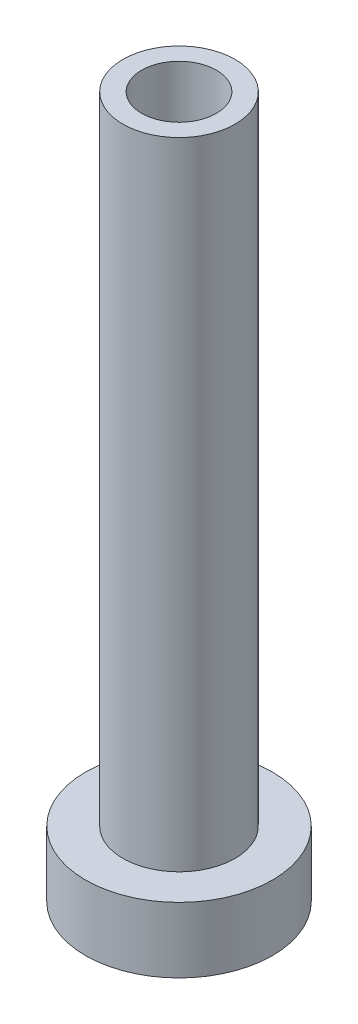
ISO-10303-21;
HEADER;
FILE_DESCRIPTION(('STEP AP214'),'2;1');
FILE_NAME('part.step','',(''),(''),'','','');
FILE_SCHEMA(('AUTOMOTIVE_DESIGN { 1 0 10303 214 1 1 1 1 }'));
ENDSEC;
DATA;
#1=APPLICATION_CONTEXT('core data for automotive mechanical design processes');
#2=APPLICATION_PROTOCOL_DEFINITION('international standard','automotive_design',2000,#1);
#3=PRODUCT_CONTEXT('',#1,'mechanical');
#4=PRODUCT('Part','Part','',(#3));
#5=PRODUCT_RELATED_PRODUCT_CATEGORY('part','',(#4));
#6=PRODUCT_DEFINITION_FORMATION('','',#4);
#7=PRODUCT_DEFINITION_CONTEXT('part definition',#1,'design');
#8=PRODUCT_DEFINITION('design','',#6,#7);
#9=PRODUCT_DEFINITION_SHAPE('','',#8);
#10=(LENGTH_UNIT() NAMED_UNIT(*) SI_UNIT(.MILLI.,.METRE.));
#11=(NAMED_UNIT(*) PLANE_ANGLE_UNIT() SI_UNIT($,.RADIAN.));
#12=(NAMED_UNIT(*) SI_UNIT($,.STERADIAN.) SOLID_ANGLE_UNIT());
#13=UNCERTAINTY_MEASURE_WITH_UNIT(LENGTH_MEASURE(1.E-05),#10,'distance_accuracy_value','');
#14=(GEOMETRIC_REPRESENTATION_CONTEXT(3) GLOBAL_UNCERTAINTY_ASSIGNED_CONTEXT((#13)) GLOBAL_UNIT_ASSIGNED_CONTEXT((#10,
#11,#12)) REPRESENTATION_CONTEXT('',''));
#15=CARTESIAN_POINT('',(0.,0.,0.));
#16=DIRECTION('',(0.,0.,1.));
#17=DIRECTION('',(1.,0.,0.));
#18=AXIS2_PLACEMENT_3D('',#15,#16,#17);
#19=CARTESIAN_POINT('',(0.,0.,0.));
#20=DIRECTION('',(0.,-1.,0.));
#21=DIRECTION('',(0.,0.,-1.));
#22=AXIS2_PLACEMENT_3D('',#19,#20,#21);
#23=CYLINDRICAL_SURFACE('',#22,10.);
#24=CARTESIAN_POINT('',(0.,-7.,0.));
#25=DIRECTION('',(0.,-1.,0.));
#26=DIRECTION('',(0.,0.,-1.));
#27=AXIS2_PLACEMENT_3D('',#24,#25,#26);
#28=CIRCLE('',#27,10.);
#29=CARTESIAN_POINT('',(0.,-7.,-10.));
#30=VERTEX_POINT('',#29);
#31=EDGE_CURVE('E41',#30,#30,#28,.T.);
#32=ORIENTED_EDGE('',*,*,#31,.F.);
#33=EDGE_LOOP('',(#32));
#34=FACE_BOUND('',#33,.T.);
#35=CARTESIAN_POINT('',(0.,0.,0.));
#36=DIRECTION('',(0.,-1.,0.));
#37=DIRECTION('',(0.,0.,-1.));
#38=AXIS2_PLACEMENT_3D('',#35,#36,#37);
#39=CIRCLE('',#38,10.);
#40=CARTESIAN_POINT('',(0.,0.,-10.));
#41=VERTEX_POINT('',#40);
#42=EDGE_CURVE('E8',#41,#41,#39,.T.);
#43=ORIENTED_EDGE('',*,*,#42,.T.);
#44=EDGE_LOOP('',(#43));
#45=FACE_BOUND('',#44,.T.);
#46=ADVANCED_FACE('F13',(#34,#45),#23,.T.);
#47=CARTESIAN_POINT('',(-10.,0.,0.));
#48=DIRECTION('',(0.,-1.,0.));
#49=DIRECTION('',(0.,0.,-1.));
#50=AXIS2_PLACEMENT_3D('',#47,#48,#49);
#51=PLANE('',#50);
#52=ORIENTED_EDGE('',*,*,#42,.F.);
#53=EDGE_LOOP('',(#52));
#54=FACE_BOUND('',#53,.T.);
#55=CARTESIAN_POINT('',(0.,0.,0.));
#56=DIRECTION('',(0.,-1.,0.));
#57=DIRECTION('',(0.,0.,-1.));
#58=AXIS2_PLACEMENT_3D('',#55,#56,#57);
#59=CIRCLE('',#58,6.);
#60=CARTESIAN_POINT('',(0.,0.,-6.));
#61=VERTEX_POINT('',#60);
#62=EDGE_CURVE('E19',#61,#61,#59,.T.);
#63=ORIENTED_EDGE('',*,*,#62,.T.);
#64=EDGE_LOOP('',(#63));
#65=FACE_BOUND('',#64,.T.);
#66=ADVANCED_FACE('F48',(#54,#65),#51,.F.);
#67=CARTESIAN_POINT('',(0.,0.,0.));
#68=DIRECTION('',(0.,-1.,0.));
#69=DIRECTION('',(0.,0.,-1.));
#70=AXIS2_PLACEMENT_3D('',#67,#68,#69);
#71=CYLINDRICAL_SURFACE('',#70,6.);
#72=ORIENTED_EDGE('',*,*,#62,.F.);
#73=EDGE_LOOP('',(#72));
#74=FACE_BOUND('',#73,.T.);
#75=CARTESIAN_POINT('',(0.,68.,0.));
#76=DIRECTION('',(0.,-1.,0.));
#77=DIRECTION('',(0.,0.,-1.));
#78=AXIS2_PLACEMENT_3D('',#75,#76,#77);
#79=CIRCLE('',#78,6.);
#80=CARTESIAN_POINT('',(0.,68.,-6.));
#81=VERTEX_POINT('',#80);
#82=EDGE_CURVE('E23',#81,#81,#79,.T.);
#83=ORIENTED_EDGE('',*,*,#82,.T.);
#84=EDGE_LOOP('',(#83));
#85=FACE_BOUND('',#84,.T.);
#86=ADVANCED_FACE('F54',(#74,#85),#71,.T.);
#87=CARTESIAN_POINT('',(-6.,68.,0.));
#88=DIRECTION('',(0.,-1.,0.));
#89=DIRECTION('',(0.,0.,-1.));
#90=AXIS2_PLACEMENT_3D('',#87,#88,#89);
#91=PLANE('',#90);
#92=ORIENTED_EDGE('',*,*,#82,.F.);
#93=EDGE_LOOP('',(#92));
#94=FACE_BOUND('',#93,.T.);
#95=CARTESIAN_POINT('',(0.,68.,0.));
#96=DIRECTION('',(0.,-1.,0.));
#97=DIRECTION('',(0.,0.,-1.));
#98=AXIS2_PLACEMENT_3D('',#95,#96,#97);
#99=CIRCLE('',#98,4.);
#100=CARTESIAN_POINT('',(0.,68.,-4.));
#101=VERTEX_POINT('',#100);
#102=EDGE_CURVE('E27',#101,#101,#99,.T.);
#103=ORIENTED_EDGE('',*,*,#102,.T.);
#104=EDGE_LOOP('',(#103));
#105=FACE_BOUND('',#104,.T.);
#106=ADVANCED_FACE('F60',(#94,#105),#91,.F.);
#107=CARTESIAN_POINT('',(0.,0.,0.));
#108=DIRECTION('',(0.,-1.,0.));
#109=DIRECTION('',(0.,0.,-1.));
#110=AXIS2_PLACEMENT_3D('',#107,#108,#109);
#111=CYLINDRICAL_SURFACE('',#110,4.);
#112=ORIENTED_EDGE('',*,*,#102,.F.);
#113=EDGE_LOOP('',(#112));
#114=FACE_BOUND('',#113,.T.);
#115=CARTESIAN_POINT('',(0.,23.,0.));
#116=DIRECTION('',(0.,-1.,0.));
#117=DIRECTION('',(0.,0.,-1.));
#118=AXIS2_PLACEMENT_3D('',#115,#116,#117);
#119=CIRCLE('',#118,4.);
#120=CARTESIAN_POINT('',(0.,23.,-4.));
#121=VERTEX_POINT('',#120);
#122=EDGE_CURVE('E32',#121,#121,#119,.T.);
#123=ORIENTED_EDGE('',*,*,#122,.T.);
#124=EDGE_LOOP('',(#123));
#125=FACE_BOUND('',#124,.T.);
#126=ADVANCED_FACE('F66',(#114,#125),#111,.F.);
#127=CARTESIAN_POINT('',(0.,22.75,0.));
#128=DIRECTION('',(0.,-1.,0.));
#129=DIRECTION('',(0.,0.,-1.));
#130=AXIS2_PLACEMENT_3D('',#127,#128,#129);
#131=CONICAL_SURFACE('',#130,4.25,0.785398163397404);
#132=ORIENTED_EDGE('',*,*,#122,.F.);
#133=EDGE_LOOP('',(#132));
#134=FACE_BOUND('',#133,.T.);
#135=CARTESIAN_POINT('',(0.,22.75,0.));
#136=DIRECTION('',(0.,-1.,0.));
#137=DIRECTION('',(0.,0.,-1.));
#138=AXIS2_PLACEMENT_3D('',#135,#136,#137);
#139=CIRCLE('',#138,4.25);
#140=CARTESIAN_POINT('',(0.,22.75,-4.25));
#141=VERTEX_POINT('',#140);
#142=EDGE_CURVE('E35',#141,#141,#139,.T.);
#143=ORIENTED_EDGE('',*,*,#142,.T.);
#144=EDGE_LOOP('',(#143));
#145=FACE_BOUND('',#144,.T.);
#146=ADVANCED_FACE('F70',(#134,#145),#131,.F.);
#147=CARTESIAN_POINT('',(0.,0.,0.));
#148=DIRECTION('',(0.,-1.,0.));
#149=DIRECTION('',(0.,0.,-1.));
#150=AXIS2_PLACEMENT_3D('',#147,#148,#149);
#151=CYLINDRICAL_SURFACE('',#150,4.25);
#152=ORIENTED_EDGE('',*,*,#142,.F.);
#153=EDGE_LOOP('',(#152));
#154=FACE_BOUND('',#153,.T.);
#155=CARTESIAN_POINT('',(0.,-7.,0.));
#156=DIRECTION('',(0.,-1.,0.));
#157=DIRECTION('',(0.,0.,-1.));
#158=AXIS2_PLACEMENT_3D('',#155,#156,#157);
#159=CIRCLE('',#158,4.25);
#160=CARTESIAN_POINT('',(0.,-7.,-4.25));
#161=VERTEX_POINT('',#160);
#162=EDGE_CURVE('E38',#161,#161,#159,.T.);
#163=ORIENTED_EDGE('',*,*,#162,.T.);
#164=EDGE_LOOP('',(#163));
#165=FACE_BOUND('',#164,.T.);
#166=ADVANCED_FACE('F74',(#154,#165),#151,.F.);
#167=CARTESIAN_POINT('',(-4.25,-7.,0.));
#168=DIRECTION('',(0.,1.,0.));
#169=DIRECTION('',(0.,0.,1.));
#170=AXIS2_PLACEMENT_3D('',#167,#168,#169);
#171=PLANE('',#170);
#172=ORIENTED_EDGE('',*,*,#162,.F.);
#173=EDGE_LOOP('',(#172));
#174=FACE_BOUND('',#173,.T.);
#175=ORIENTED_EDGE('',*,*,#31,.T.);
#176=EDGE_LOOP('',(#175));
#177=FACE_BOUND('',#176,.T.);
#178=ADVANCED_FACE('F45',(#174,#177),#171,.F.);
#179=CLOSED_SHELL('',(#46,#66,#86,#106,#126,#146,#166,#178));
#180=MANIFOLD_SOLID_BREP('B1',#179);
#181=ADVANCED_BREP_SHAPE_REPRESENTATION('',(#18,#180),#14);
#182=SHAPE_DEFINITION_REPRESENTATION(#9,#181);
ENDSEC;
END-ISO-10303-21;
